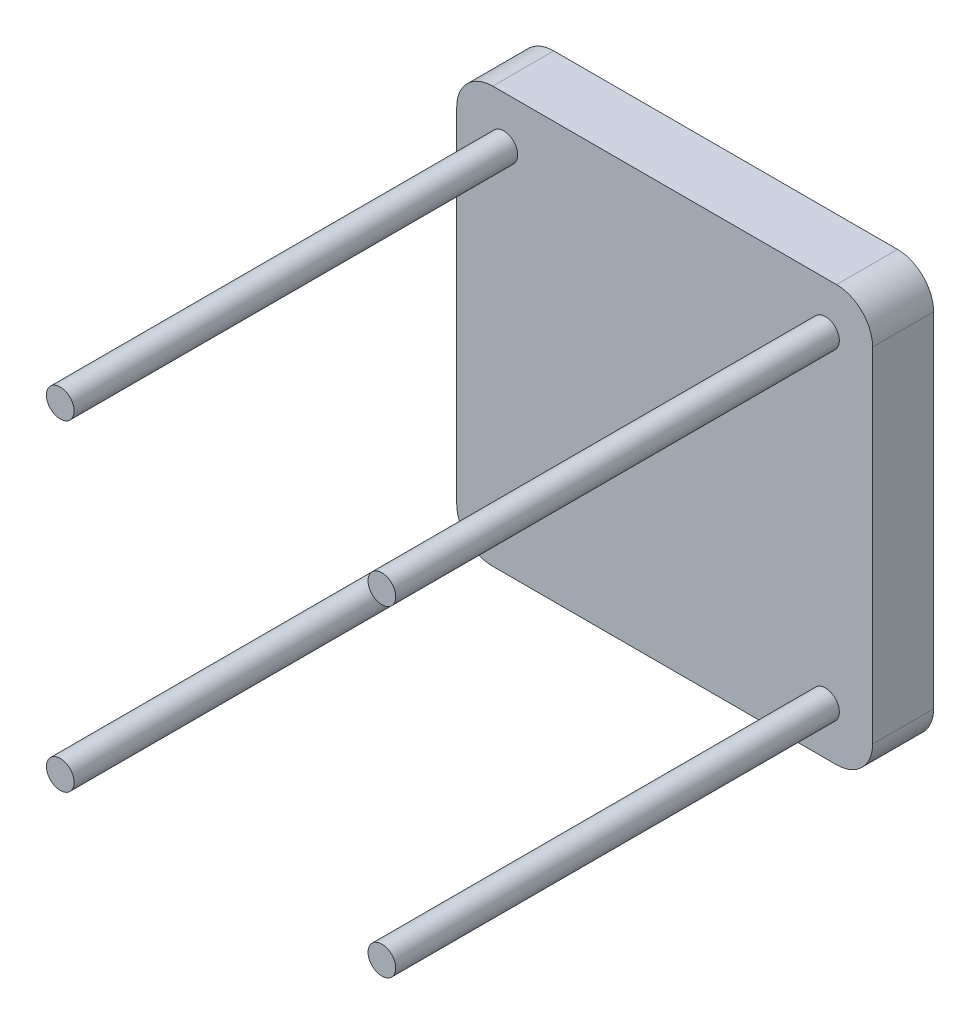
ISO-10303-21;
HEADER;
FILE_DESCRIPTION(('STEP AP214'),'2;1');
FILE_NAME('part.step','',(''),(''),'','','');
FILE_SCHEMA(('AUTOMOTIVE_DESIGN { 1 0 10303 214 1 1 1 1 }'));
ENDSEC;
DATA;
#1=APPLICATION_CONTEXT('core data for automotive mechanical design processes');
#2=APPLICATION_PROTOCOL_DEFINITION('international standard','automotive_design',2000,#1);
#3=PRODUCT_CONTEXT('',#1,'mechanical');
#4=PRODUCT('Part','Part','',(#3));
#5=PRODUCT_RELATED_PRODUCT_CATEGORY('part','',(#4));
#6=PRODUCT_DEFINITION_FORMATION('','',#4);
#7=PRODUCT_DEFINITION_CONTEXT('part definition',#1,'design');
#8=PRODUCT_DEFINITION('design','',#6,#7);
#9=PRODUCT_DEFINITION_SHAPE('','',#8);
#10=(LENGTH_UNIT() NAMED_UNIT(*) SI_UNIT(.MILLI.,.METRE.));
#11=(NAMED_UNIT(*) PLANE_ANGLE_UNIT() SI_UNIT($,.RADIAN.));
#12=(NAMED_UNIT(*) SI_UNIT($,.STERADIAN.) SOLID_ANGLE_UNIT());
#13=UNCERTAINTY_MEASURE_WITH_UNIT(LENGTH_MEASURE(1.E-05),#10,'distance_accuracy_value','');
#14=(GEOMETRIC_REPRESENTATION_CONTEXT(3) GLOBAL_UNCERTAINTY_ASSIGNED_CONTEXT((#13)) GLOBAL_UNIT_ASSIGNED_CONTEXT((#10,
#11,#12)) REPRESENTATION_CONTEXT('',''));
#15=CARTESIAN_POINT('',(0.,0.,0.));
#16=DIRECTION('',(0.,0.,1.));
#17=DIRECTION('',(1.,0.,0.));
#18=AXIS2_PLACEMENT_3D('',#15,#16,#17);
#19=CARTESIAN_POINT('',(0.,150.,22.));
#20=DIRECTION('',(0.,0.,-1.));
#21=DIRECTION('',(-1.,0.,0.));
#22=AXIS2_PLACEMENT_3D('',#19,#20,#21);
#23=PLANE('',#22);
#24=CARTESIAN_POINT('',(17.,17.,22.));
#25=DIRECTION('',(0.,0.,-1.));
#26=DIRECTION('',(-1.,0.,0.));
#27=AXIS2_PLACEMENT_3D('',#24,#25,#26);
#28=CIRCLE('',#27,4.99999999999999);
#29=CARTESIAN_POINT('',(12.,17.,22.));
#30=VERTEX_POINT('',#29);
#31=EDGE_CURVE('E37',#30,#30,#28,.F.);
#32=ORIENTED_EDGE('',*,*,#31,.F.);
#33=EDGE_LOOP('',(#32));
#34=FACE_BOUND('',#33,.T.);
#35=CARTESIAN_POINT('',(133.,17.,22.));
#36=DIRECTION('',(0.,0.,-1.));
#37=DIRECTION('',(-1.,0.,0.));
#38=AXIS2_PLACEMENT_3D('',#35,#36,#37);
#39=CIRCLE('',#38,4.99999999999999);
#40=CARTESIAN_POINT('',(128.,17.,22.));
#41=VERTEX_POINT('',#40);
#42=EDGE_CURVE('E165',#41,#41,#39,.F.);
#43=ORIENTED_EDGE('',*,*,#42,.F.);
#44=EDGE_LOOP('',(#43));
#45=FACE_BOUND('',#44,.T.);
#46=DIRECTION('',(0.,-1.,0.));
#47=VECTOR('',#46,1.);
#48=CARTESIAN_POINT('',(0.,0.,22.));
#49=LINE('',#48,#47);
#50=CARTESIAN_POINT('',(0.,137.,22.));
#51=VERTEX_POINT('',#50);
#52=CARTESIAN_POINT('',(0.,13.,22.));
#53=VERTEX_POINT('',#52);
#54=EDGE_CURVE('E133',#51,#53,#49,.T.);
#55=ORIENTED_EDGE('',*,*,#54,.T.);
#56=CARTESIAN_POINT('',(13.,13.,22.));
#57=DIRECTION('',(0.,0.,-1.));
#58=DIRECTION('',(-1.,0.,0.));
#59=AXIS2_PLACEMENT_3D('',#56,#57,#58);
#60=CIRCLE('',#59,13.);
#61=CARTESIAN_POINT('',(13.,0.,22.));
#62=VERTEX_POINT('',#61);
#63=EDGE_CURVE('E154',#53,#62,#60,.F.);
#64=ORIENTED_EDGE('',*,*,#63,.T.);
#65=DIRECTION('',(1.,0.,0.));
#66=VECTOR('',#65,1.);
#67=CARTESIAN_POINT('',(0.,0.,22.));
#68=LINE('',#67,#66);
#69=CARTESIAN_POINT('',(137.,0.,22.));
#70=VERTEX_POINT('',#69);
#71=EDGE_CURVE('E116',#62,#70,#68,.T.);
#72=ORIENTED_EDGE('',*,*,#71,.T.);
#73=CARTESIAN_POINT('',(137.,13.,22.));
#74=DIRECTION('',(0.,0.,-1.));
#75=DIRECTION('',(-1.,0.,0.));
#76=AXIS2_PLACEMENT_3D('',#73,#74,#75);
#77=CIRCLE('',#76,13.);
#78=CARTESIAN_POINT('',(150.,13.,22.));
#79=VERTEX_POINT('',#78);
#80=EDGE_CURVE('E152',#70,#79,#77,.F.);
#81=ORIENTED_EDGE('',*,*,#80,.T.);
#82=DIRECTION('',(0.,1.,0.));
#83=VECTOR('',#82,1.);
#84=CARTESIAN_POINT('',(150.,0.,22.));
#85=LINE('',#84,#83);
#86=CARTESIAN_POINT('',(150.,137.,22.));
#87=VERTEX_POINT('',#86);
#88=EDGE_CURVE('E137',#79,#87,#85,.T.);
#89=ORIENTED_EDGE('',*,*,#88,.T.);
#90=CARTESIAN_POINT('',(137.,137.,22.));
#91=DIRECTION('',(0.,0.,-1.));
#92=DIRECTION('',(-1.,0.,0.));
#93=AXIS2_PLACEMENT_3D('',#90,#91,#92);
#94=CIRCLE('',#93,13.);
#95=CARTESIAN_POINT('',(137.,150.,22.));
#96=VERTEX_POINT('',#95);
#97=EDGE_CURVE('E51',#87,#96,#94,.F.);
#98=ORIENTED_EDGE('',*,*,#97,.T.);
#99=DIRECTION('',(-1.,0.,0.));
#100=VECTOR('',#99,1.);
#101=CARTESIAN_POINT('',(0.,150.,22.));
#102=LINE('',#101,#100);
#103=CARTESIAN_POINT('',(13.,150.,22.));
#104=VERTEX_POINT('',#103);
#105=EDGE_CURVE('E139',#96,#104,#102,.T.);
#106=ORIENTED_EDGE('',*,*,#105,.T.);
#107=CARTESIAN_POINT('',(13.,137.,22.));
#108=DIRECTION('',(0.,0.,-1.));
#109=DIRECTION('',(-1.,0.,0.));
#110=AXIS2_PLACEMENT_3D('',#107,#108,#109);
#111=CIRCLE('',#110,13.);
#112=EDGE_CURVE('E150',#104,#51,#111,.F.);
#113=ORIENTED_EDGE('',*,*,#112,.T.);
#114=EDGE_LOOP('',(#55,#64,#72,#81,#89,#98,#106,#113));
#115=FACE_BOUND('',#114,.T.);
#116=CARTESIAN_POINT('',(133.,133.,22.));
#117=DIRECTION('',(0.,0.,-1.));
#118=DIRECTION('',(-1.,0.,0.));
#119=AXIS2_PLACEMENT_3D('',#116,#117,#118);
#120=CIRCLE('',#119,4.99999999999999);
#121=CARTESIAN_POINT('',(128.,133.,22.));
#122=VERTEX_POINT('',#121);
#123=EDGE_CURVE('E168',#122,#122,#120,.F.);
#124=ORIENTED_EDGE('',*,*,#123,.F.);
#125=EDGE_LOOP('',(#124));
#126=FACE_BOUND('',#125,.T.);
#127=CARTESIAN_POINT('',(17.,133.,22.));
#128=DIRECTION('',(0.,0.,-1.));
#129=DIRECTION('',(-1.,0.,0.));
#130=AXIS2_PLACEMENT_3D('',#127,#128,#129);
#131=CIRCLE('',#130,4.99999999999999);
#132=CARTESIAN_POINT('',(12.,133.,22.));
#133=VERTEX_POINT('',#132);
#134=EDGE_CURVE('E11',#133,#133,#131,.F.);
#135=ORIENTED_EDGE('',*,*,#134,.F.);
#136=EDGE_LOOP('',(#135));
#137=FACE_BOUND('',#136,.T.);
#138=ADVANCED_FACE('F29',(#34,#45,#115,#126,#137),#23,.F.);
#139=CARTESIAN_POINT('',(0.,0.,22.));
#140=DIRECTION('',(1.,0.,0.));
#141=DIRECTION('',(0.,0.,-1.));
#142=AXIS2_PLACEMENT_3D('',#139,#140,#141);
#143=PLANE('',#142);
#144=DIRECTION('',(0.,-1.,0.));
#145=VECTOR('',#144,1.);
#146=CARTESIAN_POINT('',(0.,0.,0.));
#147=LINE('',#146,#145);
#148=CARTESIAN_POINT('',(0.,137.,0.));
#149=VERTEX_POINT('',#148);
#150=CARTESIAN_POINT('',(0.,13.,0.));
#151=VERTEX_POINT('',#150);
#152=EDGE_CURVE('E123',#149,#151,#147,.T.);
#153=ORIENTED_EDGE('',*,*,#152,.T.);
#154=DIRECTION('',(0.,0.,-1.));
#155=VECTOR('',#154,1.);
#156=CARTESIAN_POINT('',(0.,13.,22.));
#157=LINE('',#156,#155);
#158=EDGE_CURVE('E101',#151,#53,#157,.F.);
#159=ORIENTED_EDGE('',*,*,#158,.T.);
#160=ORIENTED_EDGE('',*,*,#54,.F.);
#161=DIRECTION('',(0.,0.,-1.));
#162=VECTOR('',#161,1.);
#163=CARTESIAN_POINT('',(0.,137.,22.));
#164=LINE('',#163,#162);
#165=EDGE_CURVE('E106',#51,#149,#164,.T.);
#166=ORIENTED_EDGE('',*,*,#165,.T.);
#167=EDGE_LOOP('',(#153,#159,#160,#166));
#168=FACE_BOUND('',#167,.T.);
#169=ADVANCED_FACE('F31',(#168),#143,.F.);
#170=CARTESIAN_POINT('',(0.,0.,22.));
#171=DIRECTION('',(0.,1.,0.));
#172=DIRECTION('',(0.,0.,1.));
#173=AXIS2_PLACEMENT_3D('',#170,#171,#172);
#174=PLANE('',#173);
#175=ORIENTED_EDGE('',*,*,#71,.F.);
#176=DIRECTION('',(0.,0.,-1.));
#177=VECTOR('',#176,1.);
#178=CARTESIAN_POINT('',(13.,0.,22.));
#179=LINE('',#178,#177);
#180=CARTESIAN_POINT('',(13.,0.,0.));
#181=VERTEX_POINT('',#180);
#182=EDGE_CURVE('E100',#62,#181,#179,.T.);
#183=ORIENTED_EDGE('',*,*,#182,.T.);
#184=DIRECTION('',(1.,0.,0.));
#185=VECTOR('',#184,1.);
#186=CARTESIAN_POINT('',(0.,0.,0.));
#187=LINE('',#186,#185);
#188=CARTESIAN_POINT('',(137.,0.,0.));
#189=VERTEX_POINT('',#188);
#190=EDGE_CURVE('E113',#181,#189,#187,.T.);
#191=ORIENTED_EDGE('',*,*,#190,.T.);
#192=DIRECTION('',(0.,0.,-1.));
#193=VECTOR('',#192,1.);
#194=CARTESIAN_POINT('',(137.,0.,22.));
#195=LINE('',#194,#193);
#196=EDGE_CURVE('E118',#189,#70,#195,.F.);
#197=ORIENTED_EDGE('',*,*,#196,.T.);
#198=EDGE_LOOP('',(#175,#183,#191,#197));
#199=FACE_BOUND('',#198,.T.);
#200=ADVANCED_FACE('F112',(#199),#174,.F.);
#201=CARTESIAN_POINT('',(150.,0.,22.));
#202=DIRECTION('',(-1.,0.,0.));
#203=DIRECTION('',(0.,0.,1.));
#204=AXIS2_PLACEMENT_3D('',#201,#202,#203);
#205=PLANE('',#204);
#206=ORIENTED_EDGE('',*,*,#88,.F.);
#207=DIRECTION('',(0.,0.,-1.));
#208=VECTOR('',#207,1.);
#209=CARTESIAN_POINT('',(150.,13.,22.));
#210=LINE('',#209,#208);
#211=CARTESIAN_POINT('',(150.,13.,0.));
#212=VERTEX_POINT('',#211);
#213=EDGE_CURVE('E158',#79,#212,#210,.T.);
#214=ORIENTED_EDGE('',*,*,#213,.T.);
#215=DIRECTION('',(0.,1.,0.));
#216=VECTOR('',#215,1.);
#217=CARTESIAN_POINT('',(150.,0.,0.));
#218=LINE('',#217,#216);
#219=CARTESIAN_POINT('',(150.,137.,0.));
#220=VERTEX_POINT('',#219);
#221=EDGE_CURVE('E122',#212,#220,#218,.T.);
#222=ORIENTED_EDGE('',*,*,#221,.T.);
#223=DIRECTION('',(0.,0.,-1.));
#224=VECTOR('',#223,1.);
#225=CARTESIAN_POINT('',(150.,137.,22.));
#226=LINE('',#225,#224);
#227=EDGE_CURVE('E156',#220,#87,#226,.F.);
#228=ORIENTED_EDGE('',*,*,#227,.T.);
#229=EDGE_LOOP('',(#206,#214,#222,#228));
#230=FACE_BOUND('',#229,.T.);
#231=ADVANCED_FACE('F239',(#230),#205,.F.);
#232=CARTESIAN_POINT('',(0.,150.,22.));
#233=DIRECTION('',(0.,-1.,0.));
#234=DIRECTION('',(0.,0.,-1.));
#235=AXIS2_PLACEMENT_3D('',#232,#233,#234);
#236=PLANE('',#235);
#237=DIRECTION('',(-1.,0.,0.));
#238=VECTOR('',#237,1.);
#239=CARTESIAN_POINT('',(0.,150.,0.));
#240=LINE('',#239,#238);
#241=CARTESIAN_POINT('',(137.,150.,0.));
#242=VERTEX_POINT('',#241);
#243=CARTESIAN_POINT('',(13.,150.,0.));
#244=VERTEX_POINT('',#243);
#245=EDGE_CURVE('E126',#242,#244,#240,.T.);
#246=ORIENTED_EDGE('',*,*,#245,.T.);
#247=DIRECTION('',(0.,0.,-1.));
#248=VECTOR('',#247,1.);
#249=CARTESIAN_POINT('',(13.,150.,22.));
#250=LINE('',#249,#248);
#251=EDGE_CURVE('E44',#244,#104,#250,.F.);
#252=ORIENTED_EDGE('',*,*,#251,.T.);
#253=ORIENTED_EDGE('',*,*,#105,.F.);
#254=DIRECTION('',(0.,0.,-1.));
#255=VECTOR('',#254,1.);
#256=CARTESIAN_POINT('',(137.,150.,22.));
#257=LINE('',#256,#255);
#258=EDGE_CURVE('E161',#96,#242,#257,.T.);
#259=ORIENTED_EDGE('',*,*,#258,.T.);
#260=EDGE_LOOP('',(#246,#252,#253,#259));
#261=FACE_BOUND('',#260,.T.);
#262=ADVANCED_FACE('F235',(#261),#236,.F.);
#263=CARTESIAN_POINT('',(0.,150.,0.));
#264=DIRECTION('',(0.,0.,-1.));
#265=DIRECTION('',(-1.,0.,0.));
#266=AXIS2_PLACEMENT_3D('',#263,#264,#265);
#267=PLANE('',#266);
#268=ORIENTED_EDGE('',*,*,#190,.F.);
#269=CARTESIAN_POINT('',(13.,13.,0.));
#270=DIRECTION('',(0.,0.,-1.));
#271=DIRECTION('',(-1.,0.,0.));
#272=AXIS2_PLACEMENT_3D('',#269,#270,#271);
#273=CIRCLE('',#272,13.);
#274=EDGE_CURVE('E96',#181,#151,#273,.T.);
#275=ORIENTED_EDGE('',*,*,#274,.T.);
#276=ORIENTED_EDGE('',*,*,#152,.F.);
#277=CARTESIAN_POINT('',(13.,137.,0.));
#278=DIRECTION('',(0.,0.,-1.));
#279=DIRECTION('',(-1.,0.,0.));
#280=AXIS2_PLACEMENT_3D('',#277,#278,#279);
#281=CIRCLE('',#280,13.);
#282=EDGE_CURVE('E143',#149,#244,#281,.T.);
#283=ORIENTED_EDGE('',*,*,#282,.T.);
#284=ORIENTED_EDGE('',*,*,#245,.F.);
#285=CARTESIAN_POINT('',(137.,137.,0.));
#286=DIRECTION('',(0.,0.,-1.));
#287=DIRECTION('',(-1.,0.,0.));
#288=AXIS2_PLACEMENT_3D('',#285,#286,#287);
#289=CIRCLE('',#288,13.);
#290=EDGE_CURVE('E117',#242,#220,#289,.T.);
#291=ORIENTED_EDGE('',*,*,#290,.T.);
#292=ORIENTED_EDGE('',*,*,#221,.F.);
#293=CARTESIAN_POINT('',(137.,13.,0.));
#294=DIRECTION('',(0.,0.,-1.));
#295=DIRECTION('',(-1.,0.,0.));
#296=AXIS2_PLACEMENT_3D('',#293,#294,#295);
#297=CIRCLE('',#296,13.);
#298=EDGE_CURVE('E107',#212,#189,#297,.T.);
#299=ORIENTED_EDGE('',*,*,#298,.T.);
#300=EDGE_LOOP('',(#268,#275,#276,#283,#284,#291,#292,#299));
#301=FACE_BOUND('',#300,.T.);
#302=ADVANCED_FACE('F120',(#301),#267,.T.);
#303=CARTESIAN_POINT('',(13.,13.,22.));
#304=DIRECTION('',(0.,0.,-1.));
#305=DIRECTION('',(-1.,0.,0.));
#306=AXIS2_PLACEMENT_3D('',#303,#304,#305);
#307=CYLINDRICAL_SURFACE('',#306,13.);
#308=ORIENTED_EDGE('',*,*,#63,.F.);
#309=ORIENTED_EDGE('',*,*,#158,.F.);
#310=ORIENTED_EDGE('',*,*,#274,.F.);
#311=ORIENTED_EDGE('',*,*,#182,.F.);
#312=EDGE_LOOP('',(#308,#309,#310,#311));
#313=FACE_BOUND('',#312,.T.);
#314=ADVANCED_FACE('F99',(#313),#307,.T.);
#315=CARTESIAN_POINT('',(137.,13.,22.));
#316=DIRECTION('',(0.,0.,-1.));
#317=DIRECTION('',(-1.,0.,0.));
#318=AXIS2_PLACEMENT_3D('',#315,#316,#317);
#319=CYLINDRICAL_SURFACE('',#318,13.);
#320=ORIENTED_EDGE('',*,*,#80,.F.);
#321=ORIENTED_EDGE('',*,*,#196,.F.);
#322=ORIENTED_EDGE('',*,*,#298,.F.);
#323=ORIENTED_EDGE('',*,*,#213,.F.);
#324=EDGE_LOOP('',(#320,#321,#322,#323));
#325=FACE_BOUND('',#324,.T.);
#326=ADVANCED_FACE('F227',(#325),#319,.T.);
#327=CARTESIAN_POINT('',(13.,137.,22.));
#328=DIRECTION('',(0.,0.,-1.));
#329=DIRECTION('',(-1.,0.,0.));
#330=AXIS2_PLACEMENT_3D('',#327,#328,#329);
#331=CYLINDRICAL_SURFACE('',#330,13.);
#332=ORIENTED_EDGE('',*,*,#112,.F.);
#333=ORIENTED_EDGE('',*,*,#251,.F.);
#334=ORIENTED_EDGE('',*,*,#282,.F.);
#335=ORIENTED_EDGE('',*,*,#165,.F.);
#336=EDGE_LOOP('',(#332,#333,#334,#335));
#337=FACE_BOUND('',#336,.T.);
#338=ADVANCED_FACE('F223',(#337),#331,.T.);
#339=CARTESIAN_POINT('',(137.,137.,22.));
#340=DIRECTION('',(0.,0.,-1.));
#341=DIRECTION('',(-1.,0.,0.));
#342=AXIS2_PLACEMENT_3D('',#339,#340,#341);
#343=CYLINDRICAL_SURFACE('',#342,13.);
#344=ORIENTED_EDGE('',*,*,#97,.F.);
#345=ORIENTED_EDGE('',*,*,#227,.F.);
#346=ORIENTED_EDGE('',*,*,#290,.F.);
#347=ORIENTED_EDGE('',*,*,#258,.F.);
#348=EDGE_LOOP('',(#344,#345,#346,#347));
#349=FACE_BOUND('',#348,.T.);
#350=ADVANCED_FACE('F219',(#349),#343,.T.);
#351=CARTESIAN_POINT('',(133.,17.,182.));
#352=DIRECTION('',(0.,0.,-1.));
#353=DIRECTION('',(-1.,0.,0.));
#354=AXIS2_PLACEMENT_3D('',#351,#352,#353);
#355=CYLINDRICAL_SURFACE('',#354,4.99999999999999);
#356=CARTESIAN_POINT('',(133.,17.,182.));
#357=DIRECTION('',(0.,0.,1.));
#358=DIRECTION('',(1.,0.,0.));
#359=AXIS2_PLACEMENT_3D('',#356,#357,#358);
#360=CIRCLE('',#359,4.99999999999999);
#361=CARTESIAN_POINT('',(138.,17.,182.));
#362=VERTEX_POINT('',#361);
#363=EDGE_CURVE('E128',#362,#362,#360,.T.);
#364=ORIENTED_EDGE('',*,*,#363,.F.);
#365=EDGE_LOOP('',(#364));
#366=FACE_BOUND('',#365,.T.);
#367=ORIENTED_EDGE('',*,*,#42,.T.);
#368=EDGE_LOOP('',(#367));
#369=FACE_BOUND('',#368,.T.);
#370=ADVANCED_FACE('F215',(#366,#369),#355,.T.);
#371=CARTESIAN_POINT('',(133.,17.,182.));
#372=DIRECTION('',(0.,0.,1.));
#373=DIRECTION('',(1.,0.,0.));
#374=AXIS2_PLACEMENT_3D('',#371,#372,#373);
#375=PLANE('',#374);
#376=ORIENTED_EDGE('',*,*,#363,.T.);
#377=EDGE_LOOP('',(#376));
#378=FACE_BOUND('',#377,.T.);
#379=ADVANCED_FACE('F211',(#378),#375,.T.);
#380=CARTESIAN_POINT('',(133.,133.,182.));
#381=DIRECTION('',(0.,0.,-1.));
#382=DIRECTION('',(-1.,0.,0.));
#383=AXIS2_PLACEMENT_3D('',#380,#381,#382);
#384=CYLINDRICAL_SURFACE('',#383,4.99999999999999);
#385=CARTESIAN_POINT('',(133.,133.,182.));
#386=DIRECTION('',(0.,0.,1.));
#387=DIRECTION('',(1.,0.,0.));
#388=AXIS2_PLACEMENT_3D('',#385,#386,#387);
#389=CIRCLE('',#388,4.99999999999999);
#390=CARTESIAN_POINT('',(138.,133.,182.));
#391=VERTEX_POINT('',#390);
#392=EDGE_CURVE('E326',#391,#391,#389,.T.);
#393=ORIENTED_EDGE('',*,*,#392,.F.);
#394=EDGE_LOOP('',(#393));
#395=FACE_BOUND('',#394,.T.);
#396=ORIENTED_EDGE('',*,*,#123,.T.);
#397=EDGE_LOOP('',(#396));
#398=FACE_BOUND('',#397,.T.);
#399=ADVANCED_FACE('F207',(#395,#398),#384,.T.);
#400=CARTESIAN_POINT('',(133.,133.,182.));
#401=DIRECTION('',(0.,0.,1.));
#402=DIRECTION('',(1.,0.,0.));
#403=AXIS2_PLACEMENT_3D('',#400,#401,#402);
#404=PLANE('',#403);
#405=ORIENTED_EDGE('',*,*,#392,.T.);
#406=EDGE_LOOP('',(#405));
#407=FACE_BOUND('',#406,.T.);
#408=ADVANCED_FACE('F203',(#407),#404,.T.);
#409=CARTESIAN_POINT('',(17.,17.,182.));
#410=DIRECTION('',(0.,0.,-1.));
#411=DIRECTION('',(-1.,0.,0.));
#412=AXIS2_PLACEMENT_3D('',#409,#410,#411);
#413=CYLINDRICAL_SURFACE('',#412,4.99999999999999);
#414=CARTESIAN_POINT('',(17.,17.,182.));
#415=DIRECTION('',(0.,0.,1.));
#416=DIRECTION('',(1.,0.,0.));
#417=AXIS2_PLACEMENT_3D('',#414,#415,#416);
#418=CIRCLE('',#417,4.99999999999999);
#419=CARTESIAN_POINT('',(22.,17.,182.));
#420=VERTEX_POINT('',#419);
#421=EDGE_CURVE('E328',#420,#420,#418,.T.);
#422=ORIENTED_EDGE('',*,*,#421,.F.);
#423=EDGE_LOOP('',(#422));
#424=FACE_BOUND('',#423,.T.);
#425=ORIENTED_EDGE('',*,*,#31,.T.);
#426=EDGE_LOOP('',(#425));
#427=FACE_BOUND('',#426,.T.);
#428=ADVANCED_FACE('F173',(#424,#427),#413,.T.);
#429=CARTESIAN_POINT('',(17.,17.,182.));
#430=DIRECTION('',(0.,0.,1.));
#431=DIRECTION('',(1.,0.,0.));
#432=AXIS2_PLACEMENT_3D('',#429,#430,#431);
#433=PLANE('',#432);
#434=ORIENTED_EDGE('',*,*,#421,.T.);
#435=EDGE_LOOP('',(#434));
#436=FACE_BOUND('',#435,.T.);
#437=ADVANCED_FACE('F188',(#436),#433,.T.);
#438=CARTESIAN_POINT('',(17.,133.,182.));
#439=DIRECTION('',(0.,0.,-1.));
#440=DIRECTION('',(-1.,0.,0.));
#441=AXIS2_PLACEMENT_3D('',#438,#439,#440);
#442=CYLINDRICAL_SURFACE('',#441,4.99999999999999);
#443=CARTESIAN_POINT('',(17.,133.,182.));
#444=DIRECTION('',(0.,0.,1.));
#445=DIRECTION('',(1.,0.,0.));
#446=AXIS2_PLACEMENT_3D('',#443,#444,#445);
#447=CIRCLE('',#446,4.99999999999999);
#448=CARTESIAN_POINT('',(22.,133.,182.));
#449=VERTEX_POINT('',#448);
#450=EDGE_CURVE('E333',#449,#449,#447,.T.);
#451=ORIENTED_EDGE('',*,*,#450,.F.);
#452=EDGE_LOOP('',(#451));
#453=FACE_BOUND('',#452,.T.);
#454=ORIENTED_EDGE('',*,*,#134,.T.);
#455=EDGE_LOOP('',(#454));
#456=FACE_BOUND('',#455,.T.);
#457=ADVANCED_FACE('F185',(#453,#456),#442,.T.);
#458=CARTESIAN_POINT('',(17.,133.,182.));
#459=DIRECTION('',(0.,0.,1.));
#460=DIRECTION('',(1.,0.,0.));
#461=AXIS2_PLACEMENT_3D('',#458,#459,#460);
#462=PLANE('',#461);
#463=ORIENTED_EDGE('',*,*,#450,.T.);
#464=EDGE_LOOP('',(#463));
#465=FACE_BOUND('',#464,.T.);
#466=ADVANCED_FACE('F187',(#465),#462,.T.);
#467=CLOSED_SHELL('',(#138,#169,#200,#231,#262,#302,#314,#326,#338,#350,#370,#379,#399,#408,
#428,#437,#457,#466));
#468=MANIFOLD_SOLID_BREP('B2',#467);
#469=ADVANCED_BREP_SHAPE_REPRESENTATION('',(#18,#468),#14);
#470=SHAPE_DEFINITION_REPRESENTATION(#9,#469);
ENDSEC;
END-ISO-10303-21;
